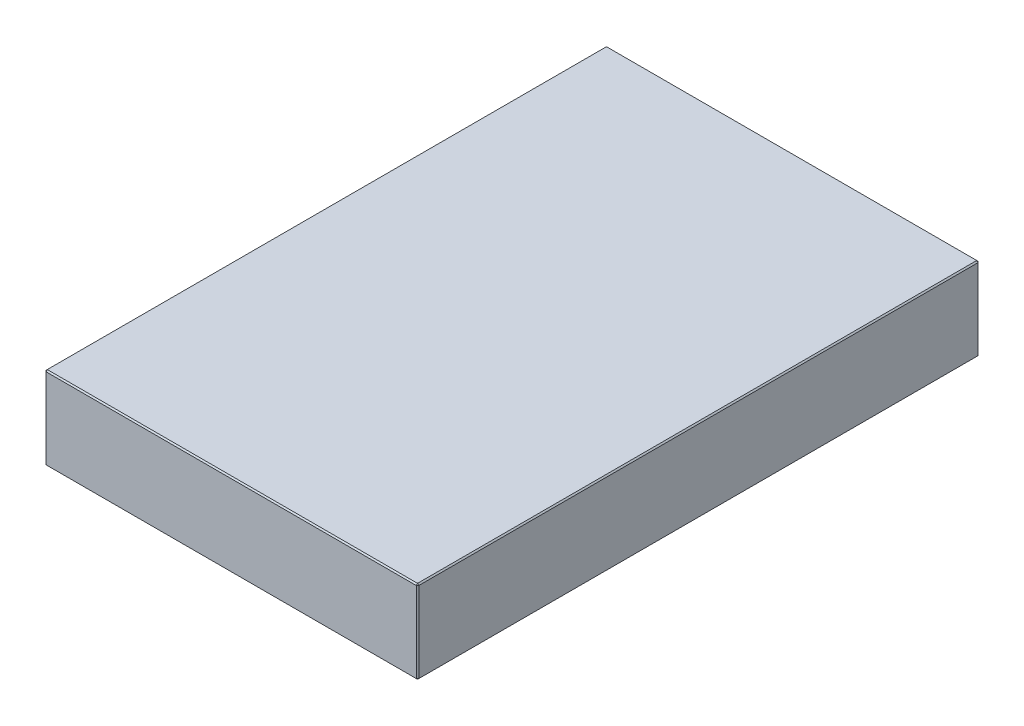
ISO-10303-21;
HEADER;
FILE_DESCRIPTION(('STEP AP214'),'2;1');
FILE_NAME('part.step','',(''),(''),'','','');
FILE_SCHEMA(('AUTOMOTIVE_DESIGN { 1 0 10303 214 1 1 1 1 }'));
ENDSEC;
DATA;
#1=APPLICATION_CONTEXT('core data for automotive mechanical design processes');
#2=APPLICATION_PROTOCOL_DEFINITION('international standard','automotive_design',2000,#1);
#3=PRODUCT_CONTEXT('',#1,'mechanical');
#4=PRODUCT('Part','Part','',(#3));
#5=PRODUCT_RELATED_PRODUCT_CATEGORY('part','',(#4));
#6=PRODUCT_DEFINITION_FORMATION('','',#4);
#7=PRODUCT_DEFINITION_CONTEXT('part definition',#1,'design');
#8=PRODUCT_DEFINITION('design','',#6,#7);
#9=PRODUCT_DEFINITION_SHAPE('','',#8);
#10=(LENGTH_UNIT() NAMED_UNIT(*) SI_UNIT(.MILLI.,.METRE.));
#11=(NAMED_UNIT(*) PLANE_ANGLE_UNIT() SI_UNIT($,.RADIAN.));
#12=(NAMED_UNIT(*) SI_UNIT($,.STERADIAN.) SOLID_ANGLE_UNIT());
#13=UNCERTAINTY_MEASURE_WITH_UNIT(LENGTH_MEASURE(1.E-05),#10,'distance_accuracy_value','');
#14=(GEOMETRIC_REPRESENTATION_CONTEXT(3) GLOBAL_UNCERTAINTY_ASSIGNED_CONTEXT((#13)) GLOBAL_UNIT_ASSIGNED_CONTEXT((#10,
#11,#12)) REPRESENTATION_CONTEXT('',''));
#15=CARTESIAN_POINT('',(0.,0.,0.));
#16=DIRECTION('',(0.,0.,1.));
#17=DIRECTION('',(1.,0.,0.));
#18=AXIS2_PLACEMENT_3D('',#15,#16,#17);
#19=CARTESIAN_POINT('',(-148.,66.,223.));
#20=DIRECTION('',(1.,0.,0.));
#21=DIRECTION('',(0.,0.,-1.));
#22=AXIS2_PLACEMENT_3D('',#19,#20,#21);
#23=PLANE('',#22);
#24=DIRECTION('',(0.,-1.,0.));
#25=VECTOR('',#24,1.);
#26=CARTESIAN_POINT('',(-148.,66.,-222.));
#27=LINE('',#26,#25);
#28=CARTESIAN_POINT('',(-148.,65.,-222.));
#29=VERTEX_POINT('',#28);
#30=CARTESIAN_POINT('',(-148.,1.,-222.));
#31=VERTEX_POINT('',#30);
#32=EDGE_CURVE('E114',#29,#31,#27,.T.);
#33=ORIENTED_EDGE('',*,*,#32,.T.);
#34=DIRECTION('',(0.,0.,1.));
#35=VECTOR('',#34,1.);
#36=CARTESIAN_POINT('',(-148.,1.,223.));
#37=LINE('',#36,#35);
#38=CARTESIAN_POINT('',(-148.,1.,222.));
#39=VERTEX_POINT('',#38);
#40=EDGE_CURVE('E110',#31,#39,#37,.T.);
#41=ORIENTED_EDGE('',*,*,#40,.T.);
#42=DIRECTION('',(0.,1.,0.));
#43=VECTOR('',#42,1.);
#44=CARTESIAN_POINT('',(-148.,66.,222.));
#45=LINE('',#44,#43);
#46=CARTESIAN_POINT('',(-148.,65.,222.));
#47=VERTEX_POINT('',#46);
#48=EDGE_CURVE('E103',#39,#47,#45,.T.);
#49=ORIENTED_EDGE('',*,*,#48,.T.);
#50=DIRECTION('',(0.,0.,-1.));
#51=VECTOR('',#50,1.);
#52=CARTESIAN_POINT('',(-148.,65.,-223.));
#53=LINE('',#52,#51);
#54=EDGE_CURVE('E107',#47,#29,#53,.T.);
#55=ORIENTED_EDGE('',*,*,#54,.T.);
#56=EDGE_LOOP('',(#33,#41,#49,#55));
#57=FACE_BOUND('',#56,.T.);
#58=ADVANCED_FACE('F15',(#57),#23,.F.);
#59=CARTESIAN_POINT('',(148.,66.,223.));
#60=DIRECTION('',(0.,0.,-1.));
#61=DIRECTION('',(-1.,0.,0.));
#62=AXIS2_PLACEMENT_3D('',#59,#60,#61);
#63=PLANE('',#62);
#64=DIRECTION('',(-1.,0.,0.));
#65=VECTOR('',#64,1.);
#66=CARTESIAN_POINT('',(-148.,65.,223.));
#67=LINE('',#66,#65);
#68=CARTESIAN_POINT('',(147.,65.,223.));
#69=VERTEX_POINT('',#68);
#70=CARTESIAN_POINT('',(-147.,65.,223.));
#71=VERTEX_POINT('',#70);
#72=EDGE_CURVE('E164',#69,#71,#67,.T.);
#73=ORIENTED_EDGE('',*,*,#72,.T.);
#74=DIRECTION('',(0.,-1.,0.));
#75=VECTOR('',#74,1.);
#76=CARTESIAN_POINT('',(-147.,66.,223.));
#77=LINE('',#76,#75);
#78=CARTESIAN_POINT('',(-147.,0.999999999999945,223.));
#79=VERTEX_POINT('',#78);
#80=EDGE_CURVE('E122',#71,#79,#77,.T.);
#81=ORIENTED_EDGE('',*,*,#80,.T.);
#82=DIRECTION('',(1.,0.,0.));
#83=VECTOR('',#82,1.);
#84=CARTESIAN_POINT('',(148.,0.999999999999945,223.));
#85=LINE('',#84,#83);
#86=CARTESIAN_POINT('',(147.,0.999999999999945,223.));
#87=VERTEX_POINT('',#86);
#88=EDGE_CURVE('E168',#79,#87,#85,.T.);
#89=ORIENTED_EDGE('',*,*,#88,.T.);
#90=DIRECTION('',(0.,1.,0.));
#91=VECTOR('',#90,1.);
#92=CARTESIAN_POINT('',(147.,66.,223.));
#93=LINE('',#92,#91);
#94=EDGE_CURVE('E166',#87,#69,#93,.T.);
#95=ORIENTED_EDGE('',*,*,#94,.T.);
#96=EDGE_LOOP('',(#73,#81,#89,#95));
#97=FACE_BOUND('',#96,.T.);
#98=ADVANCED_FACE('F275',(#97),#63,.F.);
#99=CARTESIAN_POINT('',(148.,66.,223.));
#100=DIRECTION('',(-1.,0.,0.));
#101=DIRECTION('',(0.,0.,1.));
#102=AXIS2_PLACEMENT_3D('',#99,#100,#101);
#103=PLANE('',#102);
#104=DIRECTION('',(0.,0.,-1.));
#105=VECTOR('',#104,1.);
#106=CARTESIAN_POINT('',(148.,0.999999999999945,223.));
#107=LINE('',#106,#105);
#108=CARTESIAN_POINT('',(148.,0.999999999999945,222.));
#109=VERTEX_POINT('',#108);
#110=CARTESIAN_POINT('',(148.,0.999999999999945,-222.));
#111=VERTEX_POINT('',#110);
#112=EDGE_CURVE('E159',#109,#111,#107,.T.);
#113=ORIENTED_EDGE('',*,*,#112,.T.);
#114=DIRECTION('',(0.,1.,0.));
#115=VECTOR('',#114,1.);
#116=CARTESIAN_POINT('',(148.,66.,-222.));
#117=LINE('',#116,#115);
#118=CARTESIAN_POINT('',(148.,65.,-222.));
#119=VERTEX_POINT('',#118);
#120=EDGE_CURVE('E161',#111,#119,#117,.T.);
#121=ORIENTED_EDGE('',*,*,#120,.T.);
#122=DIRECTION('',(0.,0.,1.));
#123=VECTOR('',#122,1.);
#124=CARTESIAN_POINT('',(148.,65.,223.));
#125=LINE('',#124,#123);
#126=CARTESIAN_POINT('',(148.,65.,222.));
#127=VERTEX_POINT('',#126);
#128=EDGE_CURVE('E155',#119,#127,#125,.T.);
#129=ORIENTED_EDGE('',*,*,#128,.T.);
#130=DIRECTION('',(0.,-1.,0.));
#131=VECTOR('',#130,1.);
#132=CARTESIAN_POINT('',(148.,66.,222.));
#133=LINE('',#132,#131);
#134=EDGE_CURVE('E157',#127,#109,#133,.T.);
#135=ORIENTED_EDGE('',*,*,#134,.T.);
#136=EDGE_LOOP('',(#113,#121,#129,#135));
#137=FACE_BOUND('',#136,.T.);
#138=ADVANCED_FACE('F254',(#137),#103,.F.);
#139=CARTESIAN_POINT('',(148.,66.,-223.));
#140=DIRECTION('',(0.,0.,1.));
#141=DIRECTION('',(1.,0.,0.));
#142=AXIS2_PLACEMENT_3D('',#139,#140,#141);
#143=PLANE('',#142);
#144=DIRECTION('',(0.,-1.,0.));
#145=VECTOR('',#144,1.);
#146=CARTESIAN_POINT('',(147.,66.,-223.));
#147=LINE('',#146,#145);
#148=CARTESIAN_POINT('',(147.,65.,-223.));
#149=VERTEX_POINT('',#148);
#150=CARTESIAN_POINT('',(147.,0.999999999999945,-223.));
#151=VERTEX_POINT('',#150);
#152=EDGE_CURVE('E148',#149,#151,#147,.T.);
#153=ORIENTED_EDGE('',*,*,#152,.T.);
#154=DIRECTION('',(-1.,0.,0.));
#155=VECTOR('',#154,1.);
#156=CARTESIAN_POINT('',(148.,0.999999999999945,-223.));
#157=LINE('',#156,#155);
#158=CARTESIAN_POINT('',(-147.,0.999999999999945,-223.));
#159=VERTEX_POINT('',#158);
#160=EDGE_CURVE('E153',#151,#159,#157,.T.);
#161=ORIENTED_EDGE('',*,*,#160,.T.);
#162=DIRECTION('',(0.,1.,0.));
#163=VECTOR('',#162,1.);
#164=CARTESIAN_POINT('',(-147.,66.,-223.));
#165=LINE('',#164,#163);
#166=CARTESIAN_POINT('',(-147.,65.,-223.));
#167=VERTEX_POINT('',#166);
#168=EDGE_CURVE('E150',#159,#167,#165,.T.);
#169=ORIENTED_EDGE('',*,*,#168,.T.);
#170=DIRECTION('',(1.,0.,0.));
#171=VECTOR('',#170,1.);
#172=CARTESIAN_POINT('',(148.,65.,-223.));
#173=LINE('',#172,#171);
#174=EDGE_CURVE('E146',#167,#149,#173,.T.);
#175=ORIENTED_EDGE('',*,*,#174,.T.);
#176=EDGE_LOOP('',(#153,#161,#169,#175));
#177=FACE_BOUND('',#176,.T.);
#178=ADVANCED_FACE('F284',(#177),#143,.F.);
#179=CARTESIAN_POINT('',(0.,66.,0.));
#180=DIRECTION('',(0.,1.,0.));
#181=DIRECTION('',(0.,0.,1.));
#182=AXIS2_PLACEMENT_3D('',#179,#180,#181);
#183=PLANE('',#182);
#184=DIRECTION('',(0.,0.,-1.));
#185=VECTOR('',#184,1.);
#186=CARTESIAN_POINT('',(147.,66.,-223.));
#187=LINE('',#186,#185);
#188=CARTESIAN_POINT('',(147.,66.,222.));
#189=VERTEX_POINT('',#188);
#190=CARTESIAN_POINT('',(147.,66.,-222.));
#191=VERTEX_POINT('',#190);
#192=EDGE_CURVE('E24',#189,#191,#187,.T.);
#193=ORIENTED_EDGE('',*,*,#192,.T.);
#194=DIRECTION('',(-1.,0.,0.));
#195=VECTOR('',#194,1.);
#196=CARTESIAN_POINT('',(-148.,66.,-222.));
#197=LINE('',#196,#195);
#198=CARTESIAN_POINT('',(-147.,66.,-222.));
#199=VERTEX_POINT('',#198);
#200=EDGE_CURVE('E9',#191,#199,#197,.T.);
#201=ORIENTED_EDGE('',*,*,#200,.T.);
#202=DIRECTION('',(0.,0.,1.));
#203=VECTOR('',#202,1.);
#204=CARTESIAN_POINT('',(-147.,66.,223.));
#205=LINE('',#204,#203);
#206=CARTESIAN_POINT('',(-147.,66.,222.));
#207=VERTEX_POINT('',#206);
#208=EDGE_CURVE('E180',#199,#207,#205,.T.);
#209=ORIENTED_EDGE('',*,*,#208,.T.);
#210=DIRECTION('',(1.,0.,0.));
#211=VECTOR('',#210,1.);
#212=CARTESIAN_POINT('',(148.,66.,222.));
#213=LINE('',#212,#211);
#214=EDGE_CURVE('E35',#207,#189,#213,.T.);
#215=ORIENTED_EDGE('',*,*,#214,.T.);
#216=EDGE_LOOP('',(#193,#201,#209,#215));
#217=FACE_BOUND('',#216,.T.);
#218=ADVANCED_FACE('F350',(#217),#183,.T.);
#219=CARTESIAN_POINT('',(0.,0.,0.));
#220=DIRECTION('',(0.,1.,0.));
#221=DIRECTION('',(0.,0.,1.));
#222=AXIS2_PLACEMENT_3D('',#219,#220,#221);
#223=PLANE('',#222);
#224=DIRECTION('',(0.,0.,1.));
#225=VECTOR('',#224,1.);
#226=CARTESIAN_POINT('',(147.,0.,0.));
#227=LINE('',#226,#225);
#228=CARTESIAN_POINT('',(147.,0.,-222.));
#229=VERTEX_POINT('',#228);
#230=CARTESIAN_POINT('',(147.,0.,222.));
#231=VERTEX_POINT('',#230);
#232=EDGE_CURVE('E171',#229,#231,#227,.T.);
#233=ORIENTED_EDGE('',*,*,#232,.T.);
#234=DIRECTION('',(-1.,0.,0.));
#235=VECTOR('',#234,1.);
#236=CARTESIAN_POINT('',(0.,0.,222.));
#237=LINE('',#236,#235);
#238=CARTESIAN_POINT('',(-147.,0.,222.));
#239=VERTEX_POINT('',#238);
#240=EDGE_CURVE('E177',#231,#239,#237,.T.);
#241=ORIENTED_EDGE('',*,*,#240,.T.);
#242=DIRECTION('',(0.,0.,-1.));
#243=VECTOR('',#242,1.);
#244=CARTESIAN_POINT('',(-147.,0.,0.));
#245=LINE('',#244,#243);
#246=CARTESIAN_POINT('',(-147.,0.,-222.));
#247=VERTEX_POINT('',#246);
#248=EDGE_CURVE('E175',#239,#247,#245,.T.);
#249=ORIENTED_EDGE('',*,*,#248,.T.);
#250=DIRECTION('',(1.,0.,0.));
#251=VECTOR('',#250,1.);
#252=CARTESIAN_POINT('',(0.,0.,-222.));
#253=LINE('',#252,#251);
#254=EDGE_CURVE('E173',#247,#229,#253,.T.);
#255=ORIENTED_EDGE('',*,*,#254,.T.);
#256=EDGE_LOOP('',(#233,#241,#249,#255));
#257=FACE_BOUND('',#256,.T.);
#258=ADVANCED_FACE('F246',(#257),#223,.F.);
#259=CARTESIAN_POINT('',(148.,66.,222.));
#260=DIRECTION('',(-0.707106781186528,0.,-0.707106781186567));
#261=DIRECTION('',(0.,-1.,0.));
#262=AXIS2_PLACEMENT_3D('',#259,#260,#261);
#263=PLANE('',#262);
#264=DIRECTION('',(-0.707106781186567,0.,0.707106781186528));
#265=VECTOR('',#264,1.);
#266=CARTESIAN_POINT('',(147.,65.,223.));
#267=LINE('',#266,#265);
#268=EDGE_CURVE('E19',#69,#127,#267,.F.);
#269=ORIENTED_EDGE('',*,*,#268,.F.);
#270=ORIENTED_EDGE('',*,*,#94,.F.);
#271=DIRECTION('',(0.707106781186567,0.,-0.707106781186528));
#272=VECTOR('',#271,1.);
#273=CARTESIAN_POINT('',(147.,0.999999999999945,223.));
#274=LINE('',#273,#272);
#275=EDGE_CURVE('E142',#109,#87,#274,.F.);
#276=ORIENTED_EDGE('',*,*,#275,.F.);
#277=ORIENTED_EDGE('',*,*,#134,.F.);
#278=EDGE_LOOP('',(#269,#270,#276,#277));
#279=FACE_BOUND('',#278,.T.);
#280=ADVANCED_FACE('F17',(#279),#263,.F.);
#281=CARTESIAN_POINT('',(147.,65.,223.));
#282=DIRECTION('',(0.577350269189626,0.577350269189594,0.577350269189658));
#283=DIRECTION('',(0.707106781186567,0.,-0.707106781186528));
#284=AXIS2_PLACEMENT_3D('',#281,#282,#283);
#285=PLANE('',#284);
#286=DIRECTION('',(0.,-0.707106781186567,0.707106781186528));
#287=VECTOR('',#286,1.);
#288=CARTESIAN_POINT('',(147.,65.,223.));
#289=LINE('',#288,#287);
#290=EDGE_CURVE('E226',#69,#189,#289,.F.);
#291=ORIENTED_EDGE('',*,*,#290,.F.);
#292=ORIENTED_EDGE('',*,*,#268,.T.);
#293=DIRECTION('',(-0.707106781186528,0.707106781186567,0.));
#294=VECTOR('',#293,1.);
#295=CARTESIAN_POINT('',(147.5,65.5,222.));
#296=LINE('',#295,#294);
#297=EDGE_CURVE('E228',#189,#127,#296,.F.);
#298=ORIENTED_EDGE('',*,*,#297,.F.);
#299=EDGE_LOOP('',(#291,#292,#298));
#300=FACE_BOUND('',#299,.T.);
#301=ADVANCED_FACE('F270',(#300),#285,.T.);
#302=CARTESIAN_POINT('',(147.,0.999999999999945,223.));
#303=DIRECTION('',(0.577350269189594,-0.577350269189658,0.577350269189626));
#304=DIRECTION('',(0.,-0.707106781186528,-0.707106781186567));
#305=AXIS2_PLACEMENT_3D('',#302,#303,#304);
#306=PLANE('',#305);
#307=DIRECTION('',(-0.707106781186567,-0.707106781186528,0.));
#308=VECTOR('',#307,1.);
#309=CARTESIAN_POINT('',(147.5,0.499999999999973,222.));
#310=LINE('',#309,#308);
#311=EDGE_CURVE('E220',#109,#231,#310,.T.);
#312=ORIENTED_EDGE('',*,*,#311,.F.);
#313=ORIENTED_EDGE('',*,*,#275,.T.);
#314=DIRECTION('',(0.,0.707106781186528,0.707106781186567));
#315=VECTOR('',#314,1.);
#316=CARTESIAN_POINT('',(147.,0.999999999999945,223.));
#317=LINE('',#316,#315);
#318=EDGE_CURVE('E223',#231,#87,#317,.T.);
#319=ORIENTED_EDGE('',*,*,#318,.F.);
#320=EDGE_LOOP('',(#312,#313,#319));
#321=FACE_BOUND('',#320,.T.);
#322=ADVANCED_FACE('F235',(#321),#306,.T.);
#323=CARTESIAN_POINT('',(147.,66.,0.));
#324=DIRECTION('',(0.707106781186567,0.707106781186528,0.));
#325=DIRECTION('',(0.,0.,1.));
#326=AXIS2_PLACEMENT_3D('',#323,#324,#325);
#327=PLANE('',#326);
#328=ORIENTED_EDGE('',*,*,#297,.T.);
#329=ORIENTED_EDGE('',*,*,#128,.F.);
#330=DIRECTION('',(0.707106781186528,-0.707106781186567,0.));
#331=VECTOR('',#330,1.);
#332=CARTESIAN_POINT('',(148.,65.,-222.));
#333=LINE('',#332,#331);
#334=EDGE_CURVE('E215',#191,#119,#333,.T.);
#335=ORIENTED_EDGE('',*,*,#334,.F.);
#336=ORIENTED_EDGE('',*,*,#192,.F.);
#337=EDGE_LOOP('',(#328,#329,#335,#336));
#338=FACE_BOUND('',#337,.T.);
#339=ADVANCED_FACE('F265',(#338),#327,.T.);
#340=CARTESIAN_POINT('',(0.,66.,222.));
#341=DIRECTION('',(0.,0.707106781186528,0.707106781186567));
#342=DIRECTION('',(-1.,0.,0.));
#343=AXIS2_PLACEMENT_3D('',#340,#341,#342);
#344=PLANE('',#343);
#345=ORIENTED_EDGE('',*,*,#290,.T.);
#346=ORIENTED_EDGE('',*,*,#214,.F.);
#347=DIRECTION('',(0.,0.707106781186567,-0.707106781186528));
#348=VECTOR('',#347,1.);
#349=CARTESIAN_POINT('',(-147.,65.5,222.5));
#350=LINE('',#349,#348);
#351=EDGE_CURVE('E126',#71,#207,#350,.T.);
#352=ORIENTED_EDGE('',*,*,#351,.F.);
#353=ORIENTED_EDGE('',*,*,#72,.F.);
#354=EDGE_LOOP('',(#345,#346,#352,#353));
#355=FACE_BOUND('',#354,.T.);
#356=ADVANCED_FACE('F273',(#355),#344,.T.);
#357=CARTESIAN_POINT('',(-147.,66.,223.));
#358=DIRECTION('',(0.707106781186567,0.,-0.707106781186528));
#359=DIRECTION('',(0.,-1.,0.));
#360=AXIS2_PLACEMENT_3D('',#357,#358,#359);
#361=PLANE('',#360);
#362=DIRECTION('',(0.707106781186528,0.,0.707106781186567));
#363=VECTOR('',#362,1.);
#364=CARTESIAN_POINT('',(-147.,0.999999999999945,223.));
#365=LINE('',#364,#363);
#366=EDGE_CURVE('E127',#79,#39,#365,.F.);
#367=ORIENTED_EDGE('',*,*,#366,.F.);
#368=ORIENTED_EDGE('',*,*,#80,.F.);
#369=DIRECTION('',(-0.707106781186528,0.,-0.707106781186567));
#370=VECTOR('',#369,1.);
#371=CARTESIAN_POINT('',(-148.,65.,222.));
#372=LINE('',#371,#370);
#373=EDGE_CURVE('E118',#47,#71,#372,.F.);
#374=ORIENTED_EDGE('',*,*,#373,.F.);
#375=ORIENTED_EDGE('',*,*,#48,.F.);
#376=EDGE_LOOP('',(#367,#368,#374,#375));
#377=FACE_BOUND('',#376,.T.);
#378=ADVANCED_FACE('F120',(#377),#361,.F.);
#379=CARTESIAN_POINT('',(148.,0.999999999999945,223.));
#380=DIRECTION('',(0.,0.707106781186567,-0.707106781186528));
#381=DIRECTION('',(1.,0.,0.));
#382=AXIS2_PLACEMENT_3D('',#379,#380,#381);
#383=PLANE('',#382);
#384=ORIENTED_EDGE('',*,*,#318,.T.);
#385=ORIENTED_EDGE('',*,*,#88,.F.);
#386=DIRECTION('',(0.,-0.707106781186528,-0.707106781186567));
#387=VECTOR('',#386,1.);
#388=CARTESIAN_POINT('',(-147.,0.999999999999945,223.));
#389=LINE('',#388,#387);
#390=EDGE_CURVE('E211',#239,#79,#389,.F.);
#391=ORIENTED_EDGE('',*,*,#390,.F.);
#392=ORIENTED_EDGE('',*,*,#240,.F.);
#393=EDGE_LOOP('',(#384,#385,#391,#392));
#394=FACE_BOUND('',#393,.T.);
#395=ADVANCED_FACE('F243',(#394),#383,.F.);
#396=CARTESIAN_POINT('',(148.,0.999999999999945,223.));
#397=DIRECTION('',(-0.707106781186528,0.707106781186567,0.));
#398=DIRECTION('',(0.,0.,-1.));
#399=AXIS2_PLACEMENT_3D('',#396,#397,#398);
#400=PLANE('',#399);
#401=ORIENTED_EDGE('',*,*,#311,.T.);
#402=ORIENTED_EDGE('',*,*,#232,.F.);
#403=DIRECTION('',(0.707106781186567,0.707106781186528,0.));
#404=VECTOR('',#403,1.);
#405=CARTESIAN_POINT('',(147.5,0.499999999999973,-222.));
#406=LINE('',#405,#404);
#407=EDGE_CURVE('E208',#111,#229,#406,.F.);
#408=ORIENTED_EDGE('',*,*,#407,.F.);
#409=ORIENTED_EDGE('',*,*,#112,.F.);
#410=EDGE_LOOP('',(#401,#402,#408,#409));
#411=FACE_BOUND('',#410,.T.);
#412=ADVANCED_FACE('F251',(#411),#400,.F.);
#413=CARTESIAN_POINT('',(147.,66.,-223.));
#414=DIRECTION('',(-0.707106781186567,0.,0.707106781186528));
#415=DIRECTION('',(0.,-1.,0.));
#416=AXIS2_PLACEMENT_3D('',#413,#414,#415);
#417=PLANE('',#416);
#418=DIRECTION('',(0.707106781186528,0.,0.707106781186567));
#419=VECTOR('',#418,1.);
#420=CARTESIAN_POINT('',(148.,65.,-222.));
#421=LINE('',#420,#419);
#422=EDGE_CURVE('E217',#119,#149,#421,.F.);
#423=ORIENTED_EDGE('',*,*,#422,.F.);
#424=ORIENTED_EDGE('',*,*,#120,.F.);
#425=DIRECTION('',(-0.707106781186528,0.,-0.707106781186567));
#426=VECTOR('',#425,1.);
#427=CARTESIAN_POINT('',(147.,0.999999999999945,-223.));
#428=LINE('',#427,#426);
#429=EDGE_CURVE('E205',#151,#111,#428,.F.);
#430=ORIENTED_EDGE('',*,*,#429,.F.);
#431=ORIENTED_EDGE('',*,*,#152,.F.);
#432=EDGE_LOOP('',(#423,#424,#430,#431));
#433=FACE_BOUND('',#432,.T.);
#434=ADVANCED_FACE('F258',(#433),#417,.F.);
#435=CARTESIAN_POINT('',(148.,65.,-222.));
#436=DIRECTION('',(0.577350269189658,0.577350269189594,-0.577350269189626));
#437=DIRECTION('',(-0.707106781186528,0.,-0.707106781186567));
#438=AXIS2_PLACEMENT_3D('',#435,#436,#437);
#439=PLANE('',#438);
#440=ORIENTED_EDGE('',*,*,#334,.T.);
#441=ORIENTED_EDGE('',*,*,#422,.T.);
#442=DIRECTION('',(0.,0.707106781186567,0.707106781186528));
#443=VECTOR('',#442,1.);
#444=CARTESIAN_POINT('',(147.,65.5,-222.5));
#445=LINE('',#444,#443);
#446=EDGE_CURVE('E134',#191,#149,#445,.F.);
#447=ORIENTED_EDGE('',*,*,#446,.F.);
#448=EDGE_LOOP('',(#440,#441,#447));
#449=FACE_BOUND('',#448,.T.);
#450=ADVANCED_FACE('F325',(#449),#439,.T.);
#451=CARTESIAN_POINT('',(-148.,65.,222.));
#452=DIRECTION('',(-0.577350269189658,0.577350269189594,0.577350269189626));
#453=DIRECTION('',(0.707106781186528,0.,0.707106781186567));
#454=AXIS2_PLACEMENT_3D('',#451,#452,#453);
#455=PLANE('',#454);
#456=ORIENTED_EDGE('',*,*,#373,.T.);
#457=ORIENTED_EDGE('',*,*,#351,.T.);
#458=DIRECTION('',(-0.707106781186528,-0.707106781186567,0.));
#459=VECTOR('',#458,1.);
#460=CARTESIAN_POINT('',(-148.,65.,222.));
#461=LINE('',#460,#459);
#462=EDGE_CURVE('E130',#47,#207,#461,.F.);
#463=ORIENTED_EDGE('',*,*,#462,.F.);
#464=EDGE_LOOP('',(#456,#457,#463));
#465=FACE_BOUND('',#464,.T.);
#466=ADVANCED_FACE('F131',(#465),#455,.T.);
#467=CARTESIAN_POINT('',(-147.,0.999999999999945,223.));
#468=DIRECTION('',(-0.577350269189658,-0.577350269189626,0.577350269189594));
#469=DIRECTION('',(0.707106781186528,-0.707106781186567,0.));
#470=AXIS2_PLACEMENT_3D('',#467,#468,#469);
#471=PLANE('',#470);
#472=ORIENTED_EDGE('',*,*,#390,.T.);
#473=ORIENTED_EDGE('',*,*,#366,.T.);
#474=DIRECTION('',(-0.707106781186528,0.707106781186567,0.));
#475=VECTOR('',#474,1.);
#476=CARTESIAN_POINT('',(-147.5,0.5,222.));
#477=LINE('',#476,#475);
#478=EDGE_CURVE('E135',#239,#39,#477,.T.);
#479=ORIENTED_EDGE('',*,*,#478,.F.);
#480=EDGE_LOOP('',(#472,#473,#479));
#481=FACE_BOUND('',#480,.T.);
#482=ADVANCED_FACE('F318',(#481),#471,.T.);
#483=CARTESIAN_POINT('',(147.,0.999999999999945,-223.));
#484=DIRECTION('',(0.577350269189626,-0.577350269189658,-0.577350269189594));
#485=DIRECTION('',(0.707106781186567,0.707106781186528,0.));
#486=AXIS2_PLACEMENT_3D('',#483,#484,#485);
#487=PLANE('',#486);
#488=ORIENTED_EDGE('',*,*,#429,.T.);
#489=ORIENTED_EDGE('',*,*,#407,.T.);
#490=DIRECTION('',(0.,-0.707106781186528,0.707106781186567));
#491=VECTOR('',#490,1.);
#492=CARTESIAN_POINT('',(147.,0.999999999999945,-223.));
#493=LINE('',#492,#491);
#494=EDGE_CURVE('E198',#151,#229,#493,.T.);
#495=ORIENTED_EDGE('',*,*,#494,.F.);
#496=EDGE_LOOP('',(#488,#489,#495));
#497=FACE_BOUND('',#496,.T.);
#498=ADVANCED_FACE('F314',(#497),#487,.T.);
#499=CARTESIAN_POINT('',(0.,66.,-222.));
#500=DIRECTION('',(0.,0.707106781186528,-0.707106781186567));
#501=DIRECTION('',(1.,0.,0.));
#502=AXIS2_PLACEMENT_3D('',#499,#500,#501);
#503=PLANE('',#502);
#504=ORIENTED_EDGE('',*,*,#446,.T.);
#505=ORIENTED_EDGE('',*,*,#174,.F.);
#506=DIRECTION('',(0.,-0.707106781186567,-0.707106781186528));
#507=VECTOR('',#506,1.);
#508=CARTESIAN_POINT('',(-147.,65.,-223.));
#509=LINE('',#508,#507);
#510=EDGE_CURVE('E195',#199,#167,#509,.T.);
#511=ORIENTED_EDGE('',*,*,#510,.F.);
#512=ORIENTED_EDGE('',*,*,#200,.F.);
#513=EDGE_LOOP('',(#504,#505,#511,#512));
#514=FACE_BOUND('',#513,.T.);
#515=ADVANCED_FACE('F311',(#514),#503,.T.);
#516=CARTESIAN_POINT('',(-147.,66.,0.));
#517=DIRECTION('',(-0.707106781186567,0.707106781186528,0.));
#518=DIRECTION('',(0.,0.,-1.));
#519=AXIS2_PLACEMENT_3D('',#516,#517,#518);
#520=PLANE('',#519);
#521=ORIENTED_EDGE('',*,*,#462,.T.);
#522=ORIENTED_EDGE('',*,*,#208,.F.);
#523=DIRECTION('',(0.707106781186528,0.707106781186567,0.));
#524=VECTOR('',#523,1.);
#525=CARTESIAN_POINT('',(-147.5,65.5,-222.));
#526=LINE('',#525,#524);
#527=EDGE_CURVE('E138',#29,#199,#526,.T.);
#528=ORIENTED_EDGE('',*,*,#527,.F.);
#529=ORIENTED_EDGE('',*,*,#54,.F.);
#530=EDGE_LOOP('',(#521,#522,#528,#529));
#531=FACE_BOUND('',#530,.T.);
#532=ADVANCED_FACE('F137',(#531),#520,.T.);
#533=CARTESIAN_POINT('',(-148.,1.,223.));
#534=DIRECTION('',(0.707106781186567,0.707106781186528,0.));
#535=DIRECTION('',(0.,0.,1.));
#536=AXIS2_PLACEMENT_3D('',#533,#534,#535);
#537=PLANE('',#536);
#538=ORIENTED_EDGE('',*,*,#478,.T.);
#539=ORIENTED_EDGE('',*,*,#40,.F.);
#540=DIRECTION('',(0.707106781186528,-0.707106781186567,0.));
#541=VECTOR('',#540,1.);
#542=CARTESIAN_POINT('',(-148.,1.,-222.));
#543=LINE('',#542,#541);
#544=EDGE_CURVE('E191',#247,#31,#543,.F.);
#545=ORIENTED_EDGE('',*,*,#544,.F.);
#546=ORIENTED_EDGE('',*,*,#248,.F.);
#547=EDGE_LOOP('',(#538,#539,#545,#546));
#548=FACE_BOUND('',#547,.T.);
#549=ADVANCED_FACE('F304',(#548),#537,.F.);
#550=CARTESIAN_POINT('',(148.,0.999999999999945,-223.));
#551=DIRECTION('',(0.,0.707106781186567,0.707106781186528));
#552=DIRECTION('',(-1.,0.,0.));
#553=AXIS2_PLACEMENT_3D('',#550,#551,#552);
#554=PLANE('',#553);
#555=ORIENTED_EDGE('',*,*,#494,.T.);
#556=ORIENTED_EDGE('',*,*,#254,.F.);
#557=DIRECTION('',(0.,0.707106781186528,-0.707106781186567));
#558=VECTOR('',#557,1.);
#559=CARTESIAN_POINT('',(-147.,0.499999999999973,-222.5));
#560=LINE('',#559,#558);
#561=EDGE_CURVE('E188',#159,#247,#560,.F.);
#562=ORIENTED_EDGE('',*,*,#561,.F.);
#563=ORIENTED_EDGE('',*,*,#160,.F.);
#564=EDGE_LOOP('',(#555,#556,#562,#563));
#565=FACE_BOUND('',#564,.T.);
#566=ADVANCED_FACE('F300',(#565),#554,.F.);
#567=CARTESIAN_POINT('',(-147.,65.,-223.));
#568=DIRECTION('',(-0.577350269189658,0.577350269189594,-0.577350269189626));
#569=DIRECTION('',(-0.707106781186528,0.,0.707106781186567));
#570=AXIS2_PLACEMENT_3D('',#567,#568,#569);
#571=PLANE('',#570);
#572=ORIENTED_EDGE('',*,*,#527,.T.);
#573=ORIENTED_EDGE('',*,*,#510,.T.);
#574=DIRECTION('',(0.707106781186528,0.,-0.707106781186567));
#575=VECTOR('',#574,1.);
#576=CARTESIAN_POINT('',(-147.,65.,-223.));
#577=LINE('',#576,#575);
#578=EDGE_CURVE('E186',#29,#167,#577,.T.);
#579=ORIENTED_EDGE('',*,*,#578,.F.);
#580=EDGE_LOOP('',(#572,#573,#579));
#581=FACE_BOUND('',#580,.T.);
#582=ADVANCED_FACE('F296',(#581),#571,.T.);
#583=CARTESIAN_POINT('',(-148.,1.,-222.));
#584=DIRECTION('',(-0.577350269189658,-0.577350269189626,-0.577350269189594));
#585=DIRECTION('',(0.707106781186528,-0.707106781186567,0.));
#586=AXIS2_PLACEMENT_3D('',#583,#584,#585);
#587=PLANE('',#586);
#588=ORIENTED_EDGE('',*,*,#561,.T.);
#589=ORIENTED_EDGE('',*,*,#544,.T.);
#590=DIRECTION('',(-0.707106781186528,0.,0.707106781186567));
#591=VECTOR('',#590,1.);
#592=CARTESIAN_POINT('',(-148.,1.,-222.));
#593=LINE('',#592,#591);
#594=EDGE_CURVE('E184',#159,#31,#593,.T.);
#595=ORIENTED_EDGE('',*,*,#594,.F.);
#596=EDGE_LOOP('',(#588,#589,#595));
#597=FACE_BOUND('',#596,.T.);
#598=ADVANCED_FACE('F292',(#597),#587,.T.);
#599=CARTESIAN_POINT('',(-148.,66.,-222.));
#600=DIRECTION('',(0.707106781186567,0.,0.707106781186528));
#601=DIRECTION('',(0.,-1.,0.));
#602=AXIS2_PLACEMENT_3D('',#599,#600,#601);
#603=PLANE('',#602);
#604=ORIENTED_EDGE('',*,*,#578,.T.);
#605=ORIENTED_EDGE('',*,*,#168,.F.);
#606=ORIENTED_EDGE('',*,*,#594,.T.);
#607=ORIENTED_EDGE('',*,*,#32,.F.);
#608=EDGE_LOOP('',(#604,#605,#606,#607));
#609=FACE_BOUND('',#608,.T.);
#610=ADVANCED_FACE('F289',(#609),#603,.F.);
#611=CLOSED_SHELL('',(#58,#98,#138,#178,#218,#258,#280,#301,#322,#339,#356,#378,#395,#412,#434,
#450,#466,#482,#498,#515,#532,#549,#566,#582,#598,#610));
#612=MANIFOLD_SOLID_BREP('B1',#611);
#613=ADVANCED_BREP_SHAPE_REPRESENTATION('',(#18,#612),#14);
#614=SHAPE_DEFINITION_REPRESENTATION(#9,#613);
ENDSEC;
END-ISO-10303-21;
